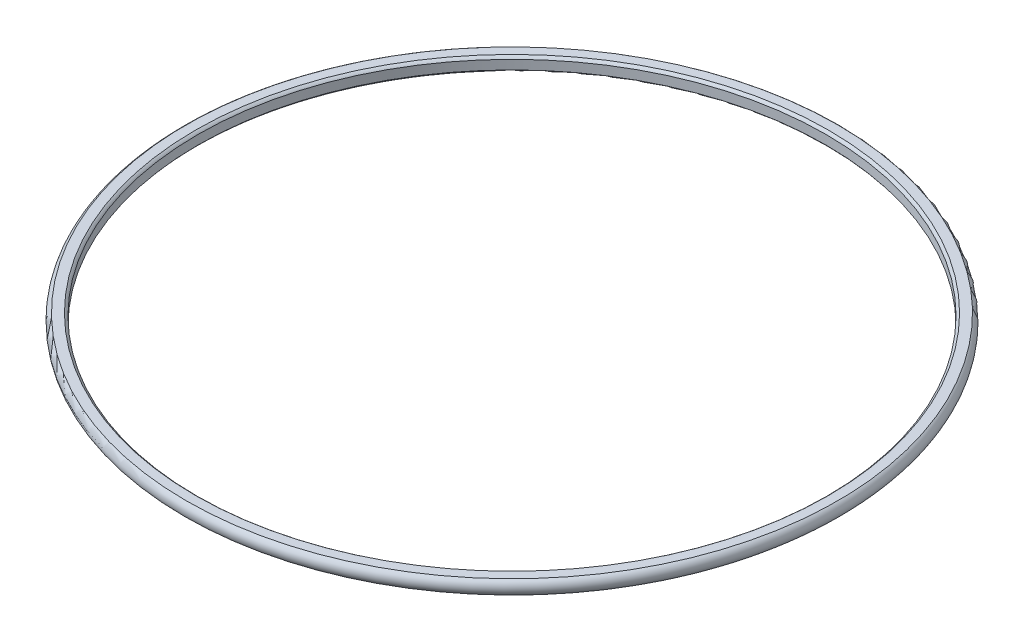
from build123d import *


with BuildPart() as part:
    # Schizzo1 → Rivoluzione1 (revolve)
    with BuildSketch(Plane.XY, mode=Mode.PRIVATE) as rivoluzione1_sk:
        with BuildLine():
            Line((33.765191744, 0), (34.744858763, 0))
            ThreePointArc((34.744858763, 0), (34.891421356, -1.391421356), (33.5, -1.244858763))
            Line((33.5, -1.244858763), (33.5, -0.265191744))
            ThreePointArc((33.5, -0.265191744), (33.61862915, -0.11862915), (33.765191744, 0))
        make_face()
    revolve(rivoluzione1_sk.sketch.rotate(Axis((0, 0, 0), (0, -1, 0)), 90), axis=Axis((0, 0, 0), (0, -1, 0)))


solid = part.part
